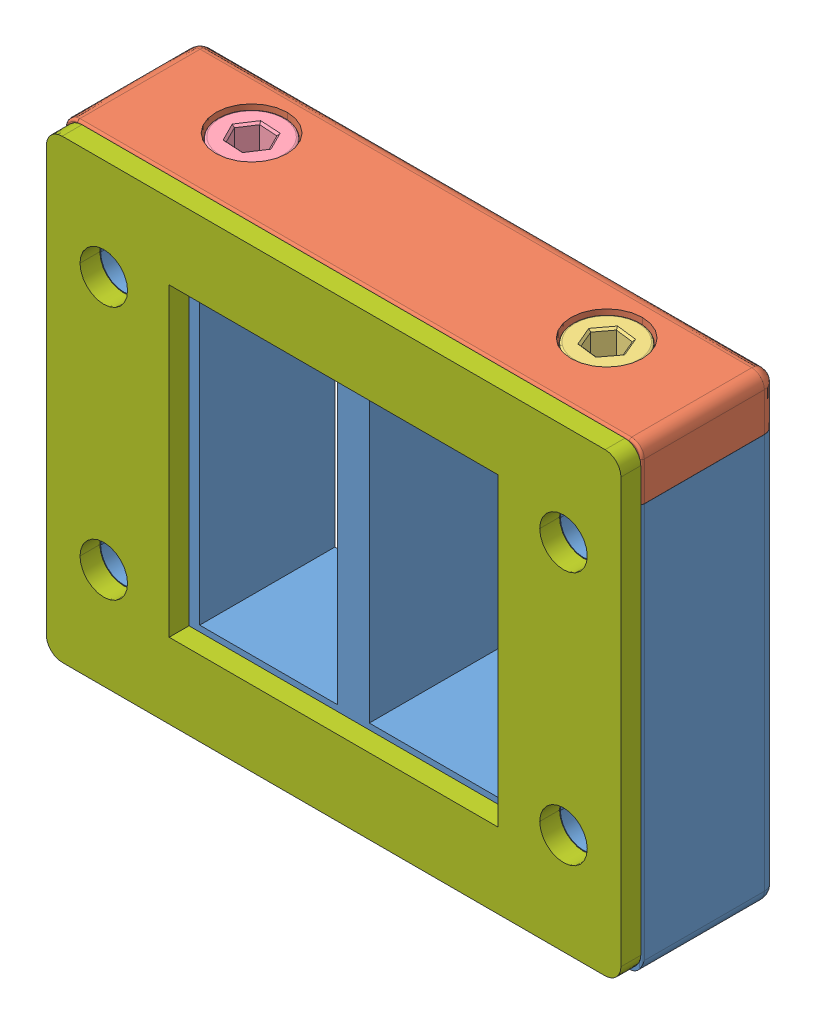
SolidWorks assembly 54204.SLDASM, configuration Default (file format 8000). Lengths in mm.
Overall size (72.82 58 19.55).
7 component instances, 7 part files, 0 mates.
Components (placement in the parent):
- 54204_01-1: 54204_01.SLDPRT [Default] at origin size (72.82 51.5 17.06)
- 54204_02-1: 54204_02.SLDPRT [Default] at origin size (72.8 10.49 17.05)
- 54204_03-1: 54204_03.SLDPRT [Default] at origin size (8.5 57 8.5)
- 54204_04-1: 54204_04.SLDPRT [Default] at origin size (8.5 57 8.5)
- 54204_05-1: 54204_05.SLDPRT [Default] at origin size (9.25 4.7 8.01)
- 54204_06-1: 54204_06.SLDPRT [Default] at origin size (9.25 4.7 8.01)
- 54204_07-1: 54204_07.SLDPRT [Default] at origin size (72.5 57.5 2.5)
